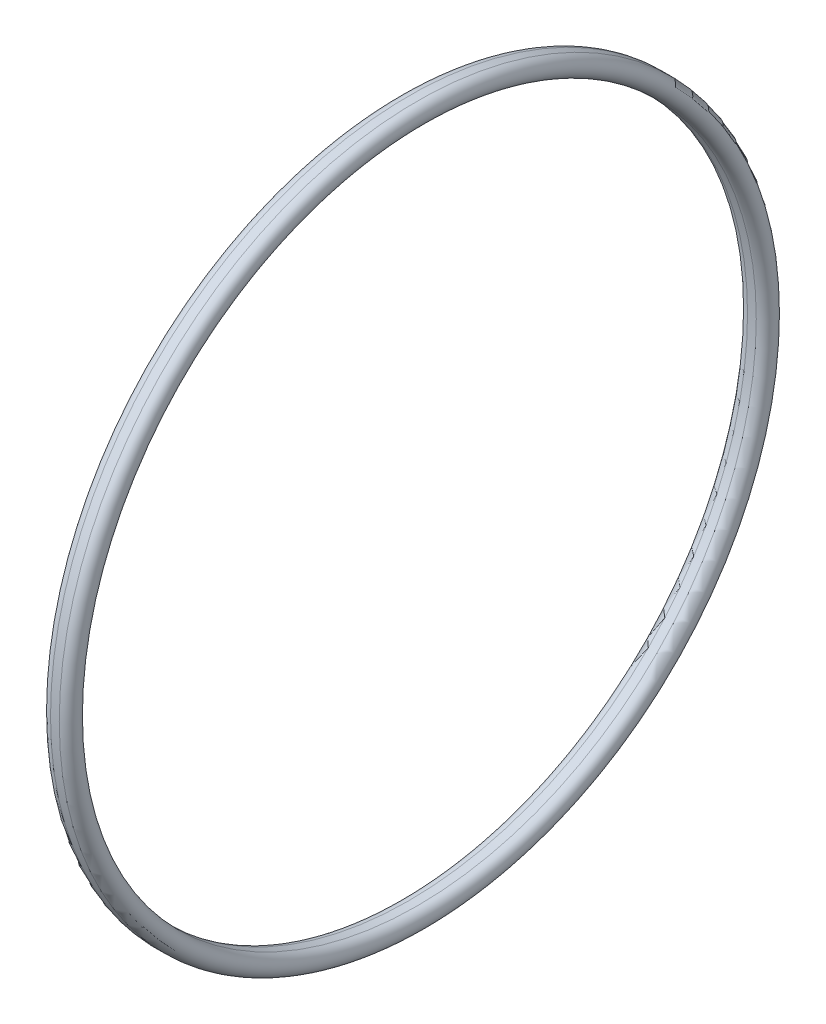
from build123d import *


with BuildPart() as part:
    # Esquisse1 → Base-R_volution (revolve)
    with BuildSketch(Plane.XY, mode=Mode.PRIVATE) as base_r_volution_sk:
        with BuildLine():
            Line((-0.625, 48.55), (0.625, 48.55))
            ThreePointArc((0.625, 48.55), (2, 49.925), (0.625, 51.3))
            Line((0.625, 51.3), (-0.625, 51.3))
            ThreePointArc((-0.625, 51.3), (-2, 49.925), (-0.625, 48.55))
        make_face()
    revolve(base_r_volution_sk.sketch.rotate(Axis((0, 0, 0), (1, 0, 0)), 90), axis=Axis((0, 0, 0), (1, 0, 0)))


solid = part.part
